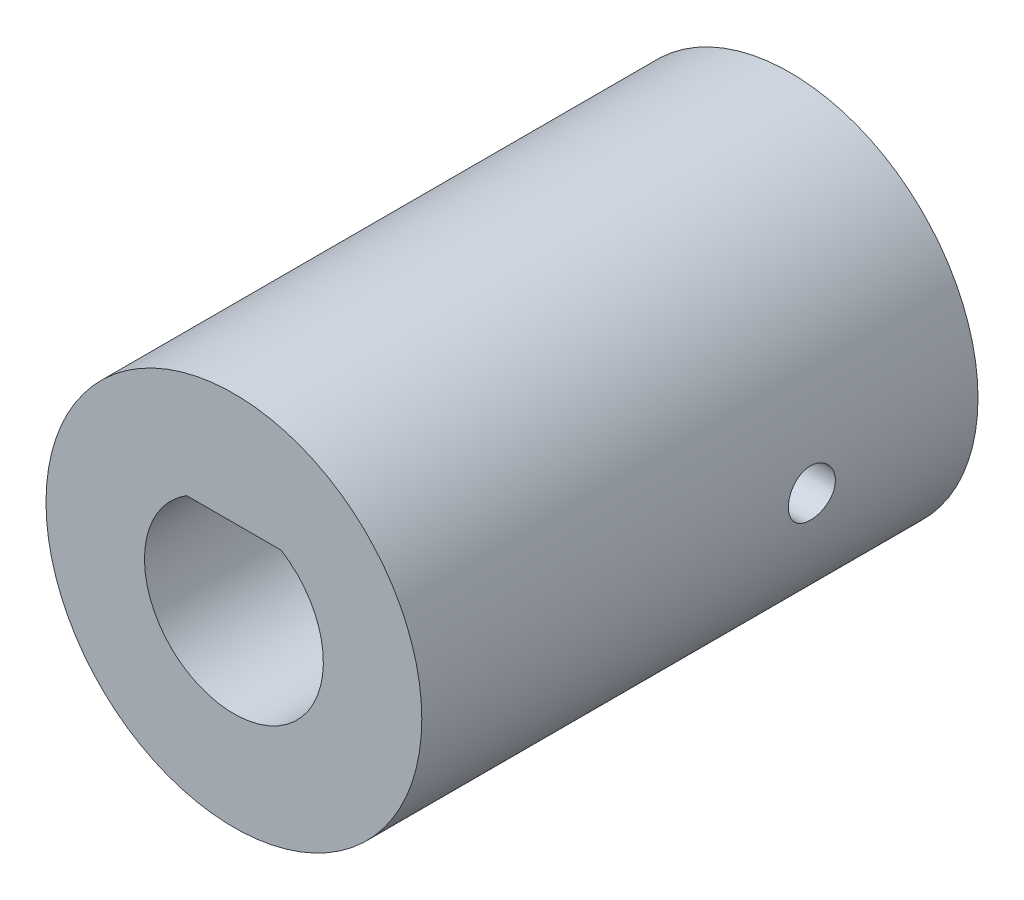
ISO-10303-21;
HEADER;
FILE_DESCRIPTION(('STEP AP214'),'2;1');
FILE_NAME('part.step','',(''),(''),'','','');
FILE_SCHEMA(('AUTOMOTIVE_DESIGN { 1 0 10303 214 1 1 1 1 }'));
ENDSEC;
DATA;
#1=APPLICATION_CONTEXT('core data for automotive mechanical design processes');
#2=APPLICATION_PROTOCOL_DEFINITION('international standard','automotive_design',2000,#1);
#3=PRODUCT_CONTEXT('',#1,'mechanical');
#4=PRODUCT('Part','Part','',(#3));
#5=PRODUCT_RELATED_PRODUCT_CATEGORY('part','',(#4));
#6=PRODUCT_DEFINITION_FORMATION('','',#4);
#7=PRODUCT_DEFINITION_CONTEXT('part definition',#1,'design');
#8=PRODUCT_DEFINITION('design','',#6,#7);
#9=PRODUCT_DEFINITION_SHAPE('','',#8);
#10=(LENGTH_UNIT() NAMED_UNIT(*) SI_UNIT(.MILLI.,.METRE.));
#11=(NAMED_UNIT(*) PLANE_ANGLE_UNIT() SI_UNIT($,.RADIAN.));
#12=(NAMED_UNIT(*) SI_UNIT($,.STERADIAN.) SOLID_ANGLE_UNIT());
#13=UNCERTAINTY_MEASURE_WITH_UNIT(LENGTH_MEASURE(1.E-05),#10,'distance_accuracy_value','');
#14=(GEOMETRIC_REPRESENTATION_CONTEXT(3) GLOBAL_UNCERTAINTY_ASSIGNED_CONTEXT((#13)) GLOBAL_UNIT_ASSIGNED_CONTEXT((#10,
#11,#12)) REPRESENTATION_CONTEXT('',''));
#15=CARTESIAN_POINT('',(0.,0.,0.));
#16=DIRECTION('',(0.,0.,1.));
#17=DIRECTION('',(1.,0.,0.));
#18=AXIS2_PLACEMENT_3D('',#15,#16,#17);
#19=CARTESIAN_POINT('',(0.,0.,18.796));
#20=DIRECTION('',(0.,0.,-1.));
#21=DIRECTION('',(-1.00000000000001,0.,0.));
#22=AXIS2_PLACEMENT_3D('',#19,#20,#21);
#23=CYLINDRICAL_SURFACE('',#22,6.35);
#24=CARTESIAN_POINT('',(-6.35000000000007,0.,4.81965000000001));
#25=CARTESIAN_POINT('',(-6.34999938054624,0.0443995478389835,4.8196518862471));
#26=CARTESIAN_POINT('',(-6.34952941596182,0.0888268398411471,4.82338788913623));
#27=CARTESIAN_POINT('',(-6.34769983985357,0.176445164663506,4.83823256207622));
#28=CARTESIAN_POINT('',(-6.3463392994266,0.219634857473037,4.84934893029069));
#29=CARTESIAN_POINT('',(-6.34288184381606,0.303496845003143,4.87862170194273));
#30=CARTESIAN_POINT('',(-6.34078542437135,0.344170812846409,4.89677336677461));
#31=CARTESIAN_POINT('',(-6.33608937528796,0.421887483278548,4.93959111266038));
#32=CARTESIAN_POINT('',(-6.33348983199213,0.458930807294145,4.9642560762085));
#33=CARTESIAN_POINT('',(-6.32806177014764,0.528546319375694,5.01954544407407));
#34=CARTESIAN_POINT('',(-6.32523218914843,0.561095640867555,5.0501985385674));
#35=CARTESIAN_POINT('',(-6.31967153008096,0.620602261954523,5.11653244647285));
#36=CARTESIAN_POINT('',(-6.31694045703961,0.647559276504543,5.15221351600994));
#37=CARTESIAN_POINT('',(-6.31187557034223,0.695201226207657,5.2277390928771));
#38=CARTESIAN_POINT('',(-6.30954312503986,0.715864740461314,5.26759721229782));
#39=CARTESIAN_POINT('',(-6.30555358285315,0.750196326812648,5.35025188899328));
#40=CARTESIAN_POINT('',(-6.30389646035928,0.763864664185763,5.39304833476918));
#41=CARTESIAN_POINT('',(-6.30145532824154,0.783748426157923,5.4801275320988));
#42=CARTESIAN_POINT('',(-6.30066679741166,0.790002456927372,5.52440133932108));
#43=CARTESIAN_POINT('',(-6.30003828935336,0.794999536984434,5.6133765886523));
#44=CARTESIAN_POINT('',(-6.30019827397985,0.793742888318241,5.65807801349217));
#45=CARTESIAN_POINT('',(-6.30144458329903,0.783785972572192,5.74637053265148));
#46=CARTESIAN_POINT('',(-6.30252561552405,0.77512823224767,5.78996650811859));
#47=CARTESIAN_POINT('',(-6.30548395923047,0.750681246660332,5.87508191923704));
#48=CARTESIAN_POINT('',(-6.30736128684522,0.734891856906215,5.9166013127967));
#49=CARTESIAN_POINT('',(-6.31170669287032,0.696584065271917,5.99651708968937));
#50=CARTESIAN_POINT('',(-6.31417638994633,0.674047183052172,6.03490452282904));
#51=CARTESIAN_POINT('',(-6.31942700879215,0.622897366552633,6.10736862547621));
#52=CARTESIAN_POINT('',(-6.32220794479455,0.594284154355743,6.14144509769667));
#53=CARTESIAN_POINT('',(-6.32779122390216,0.53155821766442,6.20456681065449));
#54=CARTESIAN_POINT('',(-6.33059358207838,0.497408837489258,6.2335756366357));
#55=CARTESIAN_POINT('',(-6.33588595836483,0.424706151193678,6.28545506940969));
#56=CARTESIAN_POINT('',(-6.33837597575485,0.386152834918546,6.30832566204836));
#57=CARTESIAN_POINT('',(-6.34276465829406,0.305708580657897,6.3472794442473));
#58=CARTESIAN_POINT('',(-6.34466312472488,0.263816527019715,6.36336035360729));
#59=CARTESIAN_POINT('',(-6.3476529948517,0.177897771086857,6.38824938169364));
#60=CARTESIAN_POINT('',(-6.34874443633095,0.133871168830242,6.39705784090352));
#61=CARTESIAN_POINT('',(-6.34999236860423,0.0452479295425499,6.40710473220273));
#62=CARTESIAN_POINT('',(-6.35015505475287,0.000657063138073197,6.40839332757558));
#63=CARTESIAN_POINT('',(-6.34954387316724,-0.0881049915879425,6.40349629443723));
#64=CARTESIAN_POINT('',(-6.34877002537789,-0.132276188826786,6.39731082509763));
#65=CARTESIAN_POINT('',(-6.34637659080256,-0.218797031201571,6.37768291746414));
#66=CARTESIAN_POINT('',(-6.34475979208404,-0.261152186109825,6.36426439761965));
#67=CARTESIAN_POINT('',(-6.34086147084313,-0.343011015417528,6.33057615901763));
#68=CARTESIAN_POINT('',(-6.33857992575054,-0.382514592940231,6.31030620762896));
#69=CARTESIAN_POINT('',(-6.33359103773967,-0.457772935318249,6.26336912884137));
#70=CARTESIAN_POINT('',(-6.33088155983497,-0.493507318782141,6.23666955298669));
#71=CARTESIAN_POINT('',(-6.32534657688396,-0.560005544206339,6.17767703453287));
#72=CARTESIAN_POINT('',(-6.32252106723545,-0.590769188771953,6.1453838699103));
#73=CARTESIAN_POINT('',(-6.31705335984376,-0.646630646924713,6.0758998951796));
#74=CARTESIAN_POINT('',(-6.31441229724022,-0.671695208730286,6.03868225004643));
#75=CARTESIAN_POINT('',(-6.30963118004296,-0.715217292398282,5.96053600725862));
#76=CARTESIAN_POINT('',(-6.30749111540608,-0.733674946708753,5.91960748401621));
#77=CARTESIAN_POINT('',(-6.30396202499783,-0.76340543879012,5.83530858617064));
#78=CARTESIAN_POINT('',(-6.30257104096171,-0.774697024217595,5.79194490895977));
#79=CARTESIAN_POINT('',(-6.30069198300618,-0.789835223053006,5.70391846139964));
#80=CARTESIAN_POINT('',(-6.30020386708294,-0.793682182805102,5.65925575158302));
#81=CARTESIAN_POINT('',(-6.30018703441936,-0.793815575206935,5.57022986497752));
#82=CARTESIAN_POINT('',(-6.30065168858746,-0.790154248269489,5.52586675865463));
#83=CARTESIAN_POINT('',(-6.30247378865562,-0.775485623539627,5.43839173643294));
#84=CARTESIAN_POINT('',(-6.30383123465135,-0.764478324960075,5.39527982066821));
#85=CARTESIAN_POINT('',(-6.30728391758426,-0.735446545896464,5.31153784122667));
#86=CARTESIAN_POINT('',(-6.3093788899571,-0.717424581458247,5.27090689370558));
#87=CARTESIAN_POINT('',(-6.3140710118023,-0.674880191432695,5.19323743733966));
#88=CARTESIAN_POINT('',(-6.31666816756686,-0.650357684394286,5.1561989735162));
#89=CARTESIAN_POINT('',(-6.32209367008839,-0.595314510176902,5.0864988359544));
#90=CARTESIAN_POINT('',(-6.3249234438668,-0.564754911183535,5.0538680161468));
#91=CARTESIAN_POINT('',(-6.33048274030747,-0.498586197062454,4.99417758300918));
#92=CARTESIAN_POINT('',(-6.33321223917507,-0.462975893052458,4.96711928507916));
#93=CARTESIAN_POINT('',(-6.33827490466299,-0.38756133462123,4.91925439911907));
#94=CARTESIAN_POINT('',(-6.34060652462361,-0.347741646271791,4.89847197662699));
#95=CARTESIAN_POINT('',(-6.34459503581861,-0.265170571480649,4.86391863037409));
#96=CARTESIAN_POINT('',(-6.34625265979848,-0.222422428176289,4.85014008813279));
#97=CARTESIAN_POINT('',(-6.34830683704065,-0.149544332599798,4.83328366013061));
#98=CARTESIAN_POINT('',(-6.34893867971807,-0.119873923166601,4.82817838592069));
#99=CARTESIAN_POINT('',(-6.34978546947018,-0.0601399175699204,4.82136092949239));
#100=CARTESIAN_POINT('',(-6.35000041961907,-0.0300763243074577,4.81964872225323));
#101=CARTESIAN_POINT('',(-6.35000000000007,0.,4.81965000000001));
#102=B_SPLINE_CURVE_WITH_KNOTS('',3,(#24,#25,#26,#27,#28,#29,#30,#31,#32,#33,#34,#35,#36,#37,
#38,#39,#40,#41,#42,#43,#44,#45,#46,#47,#48,#49,#50,#51,#52,#53,#54,#55,#56,#57,#58,#59,#60,#61,
#62,#63,#64,#65,#66,#67,#68,#69,#70,#71,#72,#73,#74,#75,#76,#77,#78,#79,#80,#81,#82,#83,#84,#85,
#86,#87,#88,#89,#90,#91,#92,#93,#94,#95,#96,#97,#98,#99,#100,#101),.UNSPECIFIED.,.T.,.F.,(4,2,2,
2,2,2,2,2,2,2,2,2,2,2,2,2,2,2,2,2,2,2,2,2,2,2,2,2,2,2,2,2,2,2,2,2,2,2,4),(0.,0.133088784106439,
0.266316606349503,0.399454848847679,0.532570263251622,0.666339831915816,0.800116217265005,
0.934342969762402,1.06856463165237,1.20208429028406,1.3355985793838,1.46835081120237,
1.60110573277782,1.73422762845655,1.86735561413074,2.00140404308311,2.13545278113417,
2.26954650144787,2.40363394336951,2.53682588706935,2.67001499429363,2.80276634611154,
2.93552220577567,3.06896262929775,3.20240835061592,3.33661375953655,3.47081647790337,
3.60466663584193,3.73851056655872,3.87142641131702,4.00434227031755,4.13721049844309,
4.27008039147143,4.40383687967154,4.53762490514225,4.67192170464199,4.8060721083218,
4.89622732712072,4.9863818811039),.UNSPECIFIED.);
#103=CARTESIAN_POINT('',(-6.35000000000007,0.,4.81965000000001));
#104=VERTEX_POINT('',#103);
#105=EDGE_CURVE('E77',#104,#104,#102,.T.);
#106=ORIENTED_EDGE('',*,*,#105,.T.);
#107=EDGE_LOOP('',(#106));
#108=FACE_BOUND('',#107,.T.);
#109=CARTESIAN_POINT('',(6.35000000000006,0.,4.81965000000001));
#110=CARTESIAN_POINT('',(6.34999938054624,-0.0443995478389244,4.8196518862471));
#111=CARTESIAN_POINT('',(6.34952941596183,-0.0888268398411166,4.82338788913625));
#112=CARTESIAN_POINT('',(6.34769983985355,-0.176445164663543,4.83823256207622));
#113=CARTESIAN_POINT('',(6.34633929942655,-0.219634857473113,4.84934893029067));
#114=CARTESIAN_POINT('',(6.34288184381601,-0.303496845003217,4.87862170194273));
#115=CARTESIAN_POINT('',(6.34078542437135,-0.344170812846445,4.89677336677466));
#116=CARTESIAN_POINT('',(6.33608937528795,-0.421887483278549,4.93959111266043));
#117=CARTESIAN_POINT('',(6.33348983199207,-0.458930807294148,4.96425607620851));
#118=CARTESIAN_POINT('',(6.32806177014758,-0.528546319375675,5.01954544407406));
#119=CARTESIAN_POINT('',(6.32523218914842,-0.561095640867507,5.05019853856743));
#120=CARTESIAN_POINT('',(6.31967153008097,-0.620602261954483,5.11653244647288));
#121=CARTESIAN_POINT('',(6.31694045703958,-0.647559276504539,5.15221351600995));
#122=CARTESIAN_POINT('',(6.31187557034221,-0.695201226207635,5.2277390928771));
#123=CARTESIAN_POINT('',(6.30954312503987,-0.715864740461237,5.26759721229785));
#124=CARTESIAN_POINT('',(6.30555358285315,-0.750196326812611,5.35025188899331));
#125=CARTESIAN_POINT('',(6.30389646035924,-0.763864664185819,5.39304833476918));
#126=CARTESIAN_POINT('',(6.30145532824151,-0.783748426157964,5.48012753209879));
#127=CARTESIAN_POINT('',(6.30066679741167,-0.790002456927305,5.52440133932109));
#128=CARTESIAN_POINT('',(6.30003828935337,-0.794999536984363,5.61337658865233));
#129=CARTESIAN_POINT('',(6.30019827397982,-0.793742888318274,5.65807801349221));
#130=CARTESIAN_POINT('',(6.30144458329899,-0.783785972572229,5.7463705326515));
#131=CARTESIAN_POINT('',(6.30252561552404,-0.775128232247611,5.78996650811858));
#132=CARTESIAN_POINT('',(6.30548395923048,-0.750681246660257,5.87508191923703));
#133=CARTESIAN_POINT('',(6.30736128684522,-0.734891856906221,5.91660131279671));
#134=CARTESIAN_POINT('',(6.31170669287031,-0.696584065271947,5.99651708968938));
#135=CARTESIAN_POINT('',(6.31417638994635,-0.674047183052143,6.03490452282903));
#136=CARTESIAN_POINT('',(6.31942700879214,-0.622897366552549,6.10736862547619));
#137=CARTESIAN_POINT('',(6.32220794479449,-0.594284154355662,6.14144509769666));
#138=CARTESIAN_POINT('',(6.32779122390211,-0.531558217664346,6.20456681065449));
#139=CARTESIAN_POINT('',(6.33059358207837,-0.49740883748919,6.23357563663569));
#140=CARTESIAN_POINT('',(6.33588595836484,-0.424706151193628,6.28545506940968));
#141=CARTESIAN_POINT('',(6.33837597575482,-0.386152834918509,6.30832566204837));
#142=CARTESIAN_POINT('',(6.34276465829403,-0.305708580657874,6.3472794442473));
#143=CARTESIAN_POINT('',(6.34466312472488,-0.263816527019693,6.36336035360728));
#144=CARTESIAN_POINT('',(6.3476529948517,-0.177897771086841,6.38824938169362));
#145=CARTESIAN_POINT('',(6.34874443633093,-0.133871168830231,6.39705784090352));
#146=CARTESIAN_POINT('',(6.34999236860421,-0.04524792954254,6.40710473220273));
#147=CARTESIAN_POINT('',(6.35015505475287,-0.000657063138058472,6.40839332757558));
#148=CARTESIAN_POINT('',(6.34954387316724,0.0881049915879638,6.40349629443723));
#149=CARTESIAN_POINT('',(6.34877002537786,0.132276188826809,6.39731082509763));
#150=CARTESIAN_POINT('',(6.34637659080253,0.218797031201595,6.37768291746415));
#151=CARTESIAN_POINT('',(6.34475979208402,0.261152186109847,6.36426439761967));
#152=CARTESIAN_POINT('',(6.34086147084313,0.343011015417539,6.33057615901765));
#153=CARTESIAN_POINT('',(6.33857992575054,0.382514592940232,6.31030620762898));
#154=CARTESIAN_POINT('',(6.33359103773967,0.457772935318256,6.2633691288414));
#155=CARTESIAN_POINT('',(6.33088155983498,0.493507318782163,6.23666955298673));
#156=CARTESIAN_POINT('',(6.32534657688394,0.56000554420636,6.17767703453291));
#157=CARTESIAN_POINT('',(6.3225210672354,0.590769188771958,6.14538386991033));
#158=CARTESIAN_POINT('',(6.31705335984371,0.646630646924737,6.07589989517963));
#159=CARTESIAN_POINT('',(6.31441229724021,0.671695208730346,6.03868225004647));
#160=CARTESIAN_POINT('',(6.30963118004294,0.715217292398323,5.96053600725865));
#161=CARTESIAN_POINT('',(6.30749111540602,0.733674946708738,5.91960748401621));
#162=CARTESIAN_POINT('',(6.30396202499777,0.763405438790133,5.83530858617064));
#163=CARTESIAN_POINT('',(6.30257104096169,0.774697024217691,5.79194490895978));
#164=CARTESIAN_POINT('',(6.30069198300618,0.789835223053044,5.70391846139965));
#165=CARTESIAN_POINT('',(6.30020386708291,0.793682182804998,5.65925575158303));
#166=CARTESIAN_POINT('',(6.30018703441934,0.793815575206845,5.5702298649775));
#167=CARTESIAN_POINT('',(6.30065168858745,0.790154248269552,5.5258667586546));
#168=CARTESIAN_POINT('',(6.30247378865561,0.775485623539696,5.43839173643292));
#169=CARTESIAN_POINT('',(6.30383123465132,0.764478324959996,5.39527982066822));
#170=CARTESIAN_POINT('',(6.30728391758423,0.735446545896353,5.31153784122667));
#171=CARTESIAN_POINT('',(6.30937888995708,0.717424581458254,5.27090689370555));
#172=CARTESIAN_POINT('',(6.31407101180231,0.674880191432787,5.19323743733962));
#173=CARTESIAN_POINT('',(6.31666816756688,0.650357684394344,5.15619897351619));
#174=CARTESIAN_POINT('',(6.3220936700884,0.595314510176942,5.08649883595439));
#175=CARTESIAN_POINT('',(6.3249234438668,0.564754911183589,5.05386801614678));
#176=CARTESIAN_POINT('',(6.33048274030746,0.498586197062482,4.99417758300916));
#177=CARTESIAN_POINT('',(6.33321223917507,0.462975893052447,4.96711928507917));
#178=CARTESIAN_POINT('',(6.33827490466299,0.387561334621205,4.91925439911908));
#179=CARTESIAN_POINT('',(6.3406065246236,0.347741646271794,4.89847197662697));
#180=CARTESIAN_POINT('',(6.3445950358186,0.265170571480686,4.86391863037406));
#181=CARTESIAN_POINT('',(6.34625265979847,0.222422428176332,4.85014008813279));
#182=CARTESIAN_POINT('',(6.34830683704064,0.149544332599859,4.83328366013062));
#183=CARTESIAN_POINT('',(6.34893867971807,0.11987392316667,4.82817838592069));
#184=CARTESIAN_POINT('',(6.34978546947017,0.060139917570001,4.82136092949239));
#185=CARTESIAN_POINT('',(6.35000041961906,0.0300763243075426,4.81964872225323));
#186=CARTESIAN_POINT('',(6.35000000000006,0.,4.81965000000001));
#187=B_SPLINE_CURVE_WITH_KNOTS('',3,(#109,#110,#111,#112,#113,#114,#115,#116,#117,#118,#119,
#120,#121,#122,#123,#124,#125,#126,#127,#128,#129,#130,#131,#132,#133,#134,#135,#136,#137,#138,
#139,#140,#141,#142,#143,#144,#145,#146,#147,#148,#149,#150,#151,#152,#153,#154,#155,#156,#157,
#158,#159,#160,#161,#162,#163,#164,#165,#166,#167,#168,#169,#170,#171,#172,#173,#174,#175,#176,
#177,#178,#179,#180,#181,#182,#183,#184,#185,#186),.UNSPECIFIED.,.T.,.F.,(4,2,2,2,2,2,2,2,2,2,2,
2,2,2,2,2,2,2,2,2,2,2,2,2,2,2,2,2,2,2,2,2,2,2,2,2,2,2,4),(0.,0.133088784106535,
0.266316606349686,0.399454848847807,0.5325702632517,0.66633983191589,0.800116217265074,
0.934342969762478,1.06856463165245,1.20208429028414,1.33559857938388,1.46835081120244,
1.60110573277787,1.73422762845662,1.86735561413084,2.00140404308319,2.13545278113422,
2.26954650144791,2.40363394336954,2.5368258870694,2.67001499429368,2.80276634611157,
2.93552220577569,3.06896262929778,3.20240835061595,3.33661375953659,3.47081647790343,
3.60466663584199,3.73851056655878,3.8714264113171,4.00434227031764,4.13721049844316,
4.27008039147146,4.4038368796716,4.53762490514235,4.67192170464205,4.80607210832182,
4.89622732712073,4.98638188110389),.UNSPECIFIED.);
#188=CARTESIAN_POINT('',(6.35000000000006,0.,4.81965000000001));
#189=VERTEX_POINT('',#188);
#190=EDGE_CURVE('E105',#189,#189,#187,.T.);
#191=ORIENTED_EDGE('',*,*,#190,.T.);
#192=EDGE_LOOP('',(#191));
#193=FACE_BOUND('',#192,.T.);
#194=CARTESIAN_POINT('',(0.,0.,18.796));
#195=DIRECTION('',(0.,0.,1.));
#196=DIRECTION('',(1.00000000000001,0.,0.));
#197=AXIS2_PLACEMENT_3D('',#194,#195,#196);
#198=CIRCLE('',#197,6.35);
#199=CARTESIAN_POINT('',(6.35000000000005,0.,18.796));
#200=VERTEX_POINT('',#199);
#201=EDGE_CURVE('E11',#200,#200,#198,.T.);
#202=ORIENTED_EDGE('',*,*,#201,.F.);
#203=EDGE_LOOP('',(#202));
#204=FACE_BOUND('',#203,.T.);
#205=CARTESIAN_POINT('',(0.,0.,0.));
#206=DIRECTION('',(0.,0.,1.));
#207=DIRECTION('',(1.00000000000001,0.,0.));
#208=AXIS2_PLACEMENT_3D('',#205,#206,#207);
#209=CIRCLE('',#208,6.35);
#210=CARTESIAN_POINT('',(6.35000000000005,0.,0.));
#211=VERTEX_POINT('',#210);
#212=EDGE_CURVE('E47',#211,#211,#209,.T.);
#213=ORIENTED_EDGE('',*,*,#212,.T.);
#214=EDGE_LOOP('',(#213));
#215=FACE_BOUND('',#214,.T.);
#216=ADVANCED_FACE('F34',(#108,#193,#204,#215),#23,.T.);
#217=CARTESIAN_POINT('',(0.,0.,18.796));
#218=DIRECTION('',(0.,0.,1.));
#219=DIRECTION('',(1.00000000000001,0.,0.));
#220=AXIS2_PLACEMENT_3D('',#217,#218,#219);
#221=PLANE('',#220);
#222=DIRECTION('',(-1.00000000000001,0.,0.));
#223=VECTOR('',#222,1.);
#224=CARTESIAN_POINT('',(0.,2.56539999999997,18.796));
#225=LINE('',#224,#223);
#226=CARTESIAN_POINT('',(1.59838468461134,2.56539999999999,18.796));
#227=VERTEX_POINT('',#226);
#228=CARTESIAN_POINT('',(-1.59838468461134,2.56539999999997,18.796));
#229=VERTEX_POINT('',#228);
#230=EDGE_CURVE('E68',#227,#229,#225,.T.);
#231=ORIENTED_EDGE('',*,*,#230,.F.);
#232=CARTESIAN_POINT('',(0.,0.,18.796));
#233=DIRECTION('',(0.,0.,1.));
#234=DIRECTION('',(1.00000000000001,0.,0.));
#235=AXIS2_PLACEMENT_3D('',#232,#233,#234);
#236=CIRCLE('',#235,3.0226);
#237=EDGE_CURVE('E74',#229,#227,#236,.T.);
#238=ORIENTED_EDGE('',*,*,#237,.F.);
#239=EDGE_LOOP('',(#231,#238));
#240=FACE_BOUND('',#239,.T.);
#241=ORIENTED_EDGE('',*,*,#201,.T.);
#242=EDGE_LOOP('',(#241));
#243=FACE_BOUND('',#242,.T.);
#244=ADVANCED_FACE('F79',(#240,#243),#221,.T.);
#245=CARTESIAN_POINT('',(0.,0.,0.));
#246=DIRECTION('',(0.,0.,1.));
#247=DIRECTION('',(1.00000000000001,0.,0.));
#248=AXIS2_PLACEMENT_3D('',#245,#246,#247);
#249=PLANE('',#248);
#250=CARTESIAN_POINT('',(0.,0.,0.));
#251=DIRECTION('',(0.,0.,1.));
#252=DIRECTION('',(1.00000000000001,0.,0.));
#253=AXIS2_PLACEMENT_3D('',#250,#251,#252);
#254=CIRCLE('',#253,3.0226);
#255=CARTESIAN_POINT('',(-1.59838468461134,2.56540000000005,0.));
#256=VERTEX_POINT('',#255);
#257=CARTESIAN_POINT('',(1.59838468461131,2.56540000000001,0.));
#258=VERTEX_POINT('',#257);
#259=EDGE_CURVE('E82',#256,#258,#254,.T.);
#260=ORIENTED_EDGE('',*,*,#259,.T.);
#261=DIRECTION('',(-1.00000000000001,0.,0.));
#262=VECTOR('',#261,1.);
#263=CARTESIAN_POINT('',(0.,2.5654,0.));
#264=LINE('',#263,#262);
#265=EDGE_CURVE('E71',#258,#256,#264,.T.);
#266=ORIENTED_EDGE('',*,*,#265,.T.);
#267=EDGE_LOOP('',(#260,#266));
#268=FACE_BOUND('',#267,.T.);
#269=ORIENTED_EDGE('',*,*,#212,.F.);
#270=EDGE_LOOP('',(#269));
#271=FACE_BOUND('',#270,.T.);
#272=ADVANCED_FACE('F123',(#268,#271),#249,.F.);
#273=CARTESIAN_POINT('',(0.,2.5654,0.));
#274=DIRECTION('',(0.,1.00000000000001,0.));
#275=DIRECTION('',(-1.00000000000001,0.,0.));
#276=AXIS2_PLACEMENT_3D('',#273,#274,#275);
#277=PLANE('',#276);
#278=ORIENTED_EDGE('',*,*,#230,.T.);
#279=DIRECTION('',(0.,0.,1.));
#280=VECTOR('',#279,1.);
#281=CARTESIAN_POINT('',(-1.59838468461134,2.56540000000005,0.));
#282=LINE('',#281,#280);
#283=EDGE_CURVE('E55',#256,#229,#282,.T.);
#284=ORIENTED_EDGE('',*,*,#283,.F.);
#285=ORIENTED_EDGE('',*,*,#265,.F.);
#286=DIRECTION('',(0.,0.,1.));
#287=VECTOR('',#286,1.);
#288=CARTESIAN_POINT('',(1.59838468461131,2.56540000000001,0.));
#289=LINE('',#288,#287);
#290=EDGE_CURVE('E60',#258,#227,#289,.T.);
#291=ORIENTED_EDGE('',*,*,#290,.T.);
#292=EDGE_LOOP('',(#278,#284,#285,#291));
#293=FACE_BOUND('',#292,.T.);
#294=ADVANCED_FACE('F66',(#293),#277,.F.);
#295=CARTESIAN_POINT('',(0.,0.,0.));
#296=DIRECTION('',(0.,0.,1.));
#297=DIRECTION('',(1.00000000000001,0.,0.));
#298=AXIS2_PLACEMENT_3D('',#295,#296,#297);
#299=CYLINDRICAL_SURFACE('',#298,3.0226);
#300=CARTESIAN_POINT('',(-3.02260000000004,0.,4.81965000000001));
#301=CARTESIAN_POINT('',(-3.02259931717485,-0.0437816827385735,4.8196510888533));
#302=CARTESIAN_POINT('',(-3.02163935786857,-0.0875751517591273,4.82328452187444));
#303=CARTESIAN_POINT('',(-3.01790306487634,-0.17390212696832,4.83769751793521));
#304=CARTESIAN_POINT('',(-3.01512581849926,-0.216434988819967,4.84848067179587));
#305=CARTESIAN_POINT('',(-3.0080617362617,-0.298982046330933,4.87681956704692));
#306=CARTESIAN_POINT('',(-3.00377681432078,-0.338999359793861,4.89436672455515));
#307=CARTESIAN_POINT('',(-2.99415109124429,-0.415522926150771,4.93570410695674));
#308=CARTESIAN_POINT('',(-2.98881022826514,-0.452028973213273,4.95949469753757));
#309=CARTESIAN_POINT('',(-2.97751542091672,-0.521316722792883,5.01320994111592));
#310=CARTESIAN_POINT('',(-2.97155124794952,-0.554007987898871,5.04324910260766));
#311=CARTESIAN_POINT('',(-2.95974825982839,-0.613951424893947,5.10836390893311));
#312=CARTESIAN_POINT('',(-2.95390946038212,-0.641202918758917,5.14344018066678));
#313=CARTESIAN_POINT('',(-2.94291406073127,-0.689930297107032,5.21835049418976));
#314=CARTESIAN_POINT('',(-2.93777038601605,-0.711302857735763,5.25825381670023));
#315=CARTESIAN_POINT('',(-2.92889771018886,-0.747000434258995,5.34124421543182));
#316=CARTESIAN_POINT('',(-2.9251684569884,-0.761326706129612,5.3843307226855));
#317=CARTESIAN_POINT('',(-2.9196523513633,-0.782212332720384,5.47146458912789));
#318=CARTESIAN_POINT('',(-2.91782464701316,-0.788935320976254,5.51547007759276));
#319=CARTESIAN_POINT('',(-2.91619646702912,-0.794933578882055,5.60401935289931));
#320=CARTESIAN_POINT('',(-2.9163956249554,-0.794210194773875,5.64856304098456));
#321=CARTESIAN_POINT('',(-2.91876206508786,-0.785466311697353,5.73565288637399));
#322=CARTESIAN_POINT('',(-2.9208761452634,-0.777643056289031,5.77822052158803));
#323=CARTESIAN_POINT('',(-2.92674913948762,-0.755237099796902,5.8614168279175));
#324=CARTESIAN_POINT('',(-2.93050818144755,-0.740653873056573,5.90204534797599));
#325=CARTESIAN_POINT('',(-2.93929484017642,-0.704979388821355,5.98072793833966));
#326=CARTESIAN_POINT('',(-2.94433594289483,-0.683818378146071,6.01874881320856));
#327=CARTESIAN_POINT('',(-2.95511137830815,-0.635637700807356,6.09076966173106));
#328=CARTESIAN_POINT('',(-2.96084584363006,-0.608616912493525,6.12476886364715));
#329=CARTESIAN_POINT('',(-2.97258396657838,-0.548471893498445,6.18890904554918));
#330=CARTESIAN_POINT('',(-2.97859040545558,-0.515181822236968,6.21889421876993));
#331=CARTESIAN_POINT('',(-2.99003303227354,-0.44397264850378,6.27288758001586));
#332=CARTESIAN_POINT('',(-2.99546919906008,-0.406053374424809,6.29689554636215));
#333=CARTESIAN_POINT('',(-3.00519056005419,-0.326425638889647,6.33831873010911));
#334=CARTESIAN_POINT('',(-3.0094709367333,-0.284702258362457,6.35570647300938));
#335=CARTESIAN_POINT('',(-3.01636356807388,-0.198786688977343,6.38317642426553));
#336=CARTESIAN_POINT('',(-3.01897617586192,-0.154595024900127,6.39326017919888));
#337=CARTESIAN_POINT('',(-3.02218578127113,-0.0663276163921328,6.40559294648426));
#338=CARTESIAN_POINT('',(-3.02283728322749,-0.02228341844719,6.408053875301));
#339=CARTESIAN_POINT('',(-3.02220760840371,0.0655881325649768,6.40565536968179));
#340=CARTESIAN_POINT('',(-3.02092662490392,0.109415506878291,6.40079666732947));
#341=CARTESIAN_POINT('',(-3.01661104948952,0.194857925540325,6.38407086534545));
#342=CARTESIAN_POINT('',(-3.01360588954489,0.236497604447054,6.37232132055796));
#343=CARTESIAN_POINT('',(-3.00618226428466,0.317211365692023,6.34228331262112));
#344=CARTESIAN_POINT('',(-3.00176364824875,0.356285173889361,6.32399415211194));
#345=CARTESIAN_POINT('',(-2.99187481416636,0.431586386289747,6.28099862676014));
#346=CARTESIAN_POINT('',(-2.98638608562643,0.467744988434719,6.25617612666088));
#347=CARTESIAN_POINT('',(-2.97499181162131,0.535458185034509,6.20096514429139));
#348=CARTESIAN_POINT('',(-2.96908618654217,0.567011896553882,6.17057559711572));
#349=CARTESIAN_POINT('',(-2.95732425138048,0.625507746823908,6.10410538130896));
#350=CARTESIAN_POINT('',(-2.9514736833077,0.652300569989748,6.06789205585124));
#351=CARTESIAN_POINT('',(-2.94066207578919,0.699431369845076,5.99136035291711));
#352=CARTESIAN_POINT('',(-2.93570099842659,0.719769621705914,5.95104215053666));
#353=CARTESIAN_POINT('',(-2.92728665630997,0.753260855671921,5.86765103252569));
#354=CARTESIAN_POINT('',(-2.92382460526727,0.766455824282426,5.82459591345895));
#355=CARTESIAN_POINT('',(-2.9187966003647,0.785388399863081,5.73677209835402));
#356=CARTESIAN_POINT('',(-2.91723017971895,0.791127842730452,5.69200382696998));
#357=CARTESIAN_POINT('',(-2.9162089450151,0.794883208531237,5.60355084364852));
#358=CARTESIAN_POINT('',(-2.91668860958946,0.79313877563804,5.55987690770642));
#359=CARTESIAN_POINT('',(-2.91955257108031,0.782529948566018,5.47346942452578));
#360=CARTESIAN_POINT('',(-2.92193682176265,0.773665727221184,5.43073585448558));
#361=CARTESIAN_POINT('',(-2.92830291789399,0.749205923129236,5.34771352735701));
#362=CARTESIAN_POINT('',(-2.93227304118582,0.733659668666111,5.30740927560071));
#363=CARTESIAN_POINT('',(-2.94136415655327,0.69631554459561,5.22995099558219));
#364=CARTESIAN_POINT('',(-2.94648532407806,0.674516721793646,5.19279744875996));
#365=CARTESIAN_POINT('',(-2.9574844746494,0.624553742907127,5.12154779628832));
#366=CARTESIAN_POINT('',(-2.96337991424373,0.596225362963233,5.08756952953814));
#367=CARTESIAN_POINT('',(-2.97516422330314,0.534321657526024,5.0247711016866));
#368=CARTESIAN_POINT('',(-2.9810530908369,0.500745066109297,4.99595218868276));
#369=CARTESIAN_POINT('',(-2.99230541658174,0.428465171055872,4.94370935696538));
#370=CARTESIAN_POINT('',(-2.99765558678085,0.389670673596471,4.92040850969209));
#371=CARTESIAN_POINT('',(-3.00708369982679,0.308576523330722,4.88069618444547));
#372=CARTESIAN_POINT('',(-3.01116248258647,0.266279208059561,4.86428015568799));
#373=CARTESIAN_POINT('',(-3.01704183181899,0.186764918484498,4.84101882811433));
#374=CARTESIAN_POINT('',(-3.01911117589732,0.149900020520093,4.83302380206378));
#375=CARTESIAN_POINT('',(-3.02189049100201,0.0753596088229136,4.82233916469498));
#376=CARTESIAN_POINT('',(-3.02260058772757,0.0376841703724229,4.81964906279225));
#377=CARTESIAN_POINT('',(-3.02260000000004,0.,4.81965000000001));
#378=B_SPLINE_CURVE_WITH_KNOTS('',3,(#300,#301,#302,#303,#304,#305,#306,#307,#308,#309,#310,
#311,#312,#313,#314,#315,#316,#317,#318,#319,#320,#321,#322,#323,#324,#325,#326,#327,#328,#329,
#330,#331,#332,#333,#334,#335,#336,#337,#338,#339,#340,#341,#342,#343,#344,#345,#346,#347,#348,
#349,#350,#351,#352,#353,#354,#355,#356,#357,#358,#359,#360,#361,#362,#363,#364,#365,#366,#367,
#368,#369,#370,#371,#372,#373,#374,#375,#376,#377),.UNSPECIFIED.,.T.,.F.,(4,2,2,2,2,2,2,2,2,2,2,
2,2,2,2,2,2,2,2,2,2,2,2,2,2,2,2,2,2,2,2,2,2,2,2,2,2,2,4),(0.,0.131206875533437,
0.262479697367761,0.393586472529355,0.524700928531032,0.658471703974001,0.792259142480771,
0.928266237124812,1.06424908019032,1.19724610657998,1.33021908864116,1.45960734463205,
1.58900566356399,1.71982588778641,1.8506711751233,1.98564979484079,2.12063341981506,
2.2561712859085,2.39168044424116,2.52338697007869,2.65508032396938,2.78458983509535,
2.91411316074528,3.04611578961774,3.17814369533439,3.3137739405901,3.44939840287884,
3.58421679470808,3.7190019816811,3.84950392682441,3.98000270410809,4.10955422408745,
4.23912550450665,4.3724026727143,4.50571203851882,4.64176160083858,4.77772109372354,
4.89066512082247,5.00359870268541),.UNSPECIFIED.);
#379=CARTESIAN_POINT('',(-3.02260000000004,0.,4.81965000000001));
#380=VERTEX_POINT('',#379);
#381=EDGE_CURVE('E38',#380,#380,#378,.T.);
#382=ORIENTED_EDGE('',*,*,#381,.T.);
#383=EDGE_LOOP('',(#382));
#384=FACE_BOUND('',#383,.T.);
#385=CARTESIAN_POINT('',(3.0226,0.,4.8196500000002));
#386=CARTESIAN_POINT('',(3.02259931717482,0.0437816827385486,4.8196510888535));
#387=CARTESIAN_POINT('',(3.02163935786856,0.087575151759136,4.82328452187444));
#388=CARTESIAN_POINT('',(3.01790306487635,0.173902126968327,4.8376975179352));
#389=CARTESIAN_POINT('',(3.01512581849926,0.216434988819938,4.84848067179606));
#390=CARTESIAN_POINT('',(3.00806173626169,0.298982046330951,4.87681956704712));
#391=CARTESIAN_POINT('',(3.00377681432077,0.33899935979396,4.89436672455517));
#392=CARTESIAN_POINT('',(2.99415109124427,0.415522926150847,4.93570410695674));
#393=CARTESIAN_POINT('',(2.98881022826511,0.452028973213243,4.95949469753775));
#394=CARTESIAN_POINT('',(2.9775154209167,0.521316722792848,5.01320994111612));
#395=CARTESIAN_POINT('',(2.97155124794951,0.554007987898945,5.0432491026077));
#396=CARTESIAN_POINT('',(2.95974825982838,0.613951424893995,5.10836390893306));
#397=CARTESIAN_POINT('',(2.95390946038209,0.641202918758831,5.14344018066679));
#398=CARTESIAN_POINT('',(2.94291406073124,0.689930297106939,5.21835049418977));
#399=CARTESIAN_POINT('',(2.93777038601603,0.711302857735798,5.25825381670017));
#400=CARTESIAN_POINT('',(2.92889771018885,0.747000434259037,5.34124421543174));
#401=CARTESIAN_POINT('',(2.92516845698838,0.761326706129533,5.38433072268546));
#402=CARTESIAN_POINT('',(2.91965235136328,0.782212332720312,5.47146458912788));
#403=CARTESIAN_POINT('',(2.91782464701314,0.788935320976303,5.51547007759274));
#404=CARTESIAN_POINT('',(2.9161964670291,0.794933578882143,5.6040193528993));
#405=CARTESIAN_POINT('',(2.91639562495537,0.794210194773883,5.64856304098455));
#406=CARTESIAN_POINT('',(2.91876206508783,0.78546631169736,5.73565288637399));
#407=CARTESIAN_POINT('',(2.92087614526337,0.777643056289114,5.77822052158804));
#408=CARTESIAN_POINT('',(2.9267491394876,0.755237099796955,5.8614168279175));
#409=CARTESIAN_POINT('',(2.93050818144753,0.740653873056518,5.90204534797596));
#410=CARTESIAN_POINT('',(2.9392948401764,0.704979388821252,5.98072793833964));
#411=CARTESIAN_POINT('',(2.94433594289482,0.683818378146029,6.01874881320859));
#412=CARTESIAN_POINT('',(2.95511137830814,0.63563770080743,6.09076966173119));
#413=CARTESIAN_POINT('',(2.96084584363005,0.608616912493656,6.12476886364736));
#414=CARTESIAN_POINT('',(2.97258396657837,0.548471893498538,6.18890904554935));
#415=CARTESIAN_POINT('',(2.97859040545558,0.51518182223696,6.21889421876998));
#416=CARTESIAN_POINT('',(2.99003303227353,0.443972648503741,6.27288758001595));
#417=CARTESIAN_POINT('',(2.99546919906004,0.406053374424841,6.29689554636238));
#418=CARTESIAN_POINT('',(3.00519056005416,0.326425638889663,6.33831873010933));
#419=CARTESIAN_POINT('',(3.00947093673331,0.284702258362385,6.35570647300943));
#420=CARTESIAN_POINT('',(3.01636356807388,0.198786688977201,6.38317642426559));
#421=CARTESIAN_POINT('',(3.01897617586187,0.154595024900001,6.39326017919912));
#422=CARTESIAN_POINT('',(3.02218578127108,0.0663276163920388,6.40559294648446));
#423=CARTESIAN_POINT('',(3.02283728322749,0.0222834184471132,6.408053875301));
#424=CARTESIAN_POINT('',(3.02220760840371,-0.0655881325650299,6.40565536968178));
#425=CARTESIAN_POINT('',(3.02092662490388,-0.109415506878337,6.40079666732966));
#426=CARTESIAN_POINT('',(3.01661104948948,-0.194857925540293,6.38407086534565));
#427=CARTESIAN_POINT('',(3.0136058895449,-0.236497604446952,6.37232132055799));
#428=CARTESIAN_POINT('',(3.00618226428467,-0.317211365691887,6.34228331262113));
#429=CARTESIAN_POINT('',(3.00176364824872,-0.356285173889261,6.3239941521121));
#430=CARTESIAN_POINT('',(2.99187481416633,-0.431586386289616,6.28099862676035));
#431=CARTESIAN_POINT('',(2.98638608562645,-0.467744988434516,6.25617612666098));
#432=CARTESIAN_POINT('',(2.97499181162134,-0.535458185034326,6.20096514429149));
#433=CARTESIAN_POINT('',(2.96908618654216,-0.567011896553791,6.17057559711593));
#434=CARTESIAN_POINT('',(2.95732425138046,-0.625507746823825,6.10410538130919));
#435=CARTESIAN_POINT('',(2.95147368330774,-0.652300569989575,6.06789205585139));
#436=CARTESIAN_POINT('',(2.94066207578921,-0.699431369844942,5.99136035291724));
#437=CARTESIAN_POINT('',(2.93570099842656,-0.71976962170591,5.95104215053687));
#438=CARTESIAN_POINT('',(2.92728665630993,-0.753260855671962,5.86765103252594));
#439=CARTESIAN_POINT('',(2.92382460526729,-0.766455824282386,5.82459591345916));
#440=CARTESIAN_POINT('',(2.91879660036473,-0.785388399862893,5.73677209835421));
#441=CARTESIAN_POINT('',(2.91723017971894,-0.791127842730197,5.69200382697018));
#442=CARTESIAN_POINT('',(2.91620894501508,-0.794883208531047,5.60355084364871));
#443=CARTESIAN_POINT('',(2.91668860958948,-0.793138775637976,5.5598769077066));
#444=CARTESIAN_POINT('',(2.91955257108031,-0.782529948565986,5.47346942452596));
#445=CARTESIAN_POINT('',(2.92193682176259,-0.77366572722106,5.43073585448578));
#446=CARTESIAN_POINT('',(2.92830291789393,-0.749205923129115,5.34771352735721));
#447=CARTESIAN_POINT('',(2.93227304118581,-0.733659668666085,5.30740927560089));
#448=CARTESIAN_POINT('',(2.94136415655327,-0.696315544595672,5.22995099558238));
#449=CARTESIAN_POINT('',(2.94648532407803,-0.6745167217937,5.19279744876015));
#450=CARTESIAN_POINT('',(2.95748447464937,-0.6245537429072,5.12154779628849));
#451=CARTESIAN_POINT('',(2.96337991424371,-0.59622536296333,5.08756952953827));
#452=CARTESIAN_POINT('',(2.97516422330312,-0.534321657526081,5.02477110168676));
#453=CARTESIAN_POINT('',(2.98105309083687,-0.500745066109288,4.99595218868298));
#454=CARTESIAN_POINT('',(2.99230541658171,-0.428465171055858,4.94370935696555));
#455=CARTESIAN_POINT('',(2.99765558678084,-0.389670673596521,4.92040850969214));
#456=CARTESIAN_POINT('',(3.00708369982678,-0.308576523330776,4.88069618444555));
#457=CARTESIAN_POINT('',(3.01116248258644,-0.266279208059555,4.86428015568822));
#458=CARTESIAN_POINT('',(3.01704183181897,-0.186764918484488,4.84101882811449));
#459=CARTESIAN_POINT('',(3.01911117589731,-0.149900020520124,4.83302380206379));
#460=CARTESIAN_POINT('',(3.021890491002,-0.0753596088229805,4.822339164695));
#461=CARTESIAN_POINT('',(3.02260058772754,-0.0376841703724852,4.81964906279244));
#462=CARTESIAN_POINT('',(3.0226,0.,4.8196500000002));
#463=B_SPLINE_CURVE_WITH_KNOTS('',3,(#385,#386,#387,#388,#389,#390,#391,#392,#393,#394,#395,
#396,#397,#398,#399,#400,#401,#402,#403,#404,#405,#406,#407,#408,#409,#410,#411,#412,#413,#414,
#415,#416,#417,#418,#419,#420,#421,#422,#423,#424,#425,#426,#427,#428,#429,#430,#431,#432,#433,
#434,#435,#436,#437,#438,#439,#440,#441,#442,#443,#444,#445,#446,#447,#448,#449,#450,#451,#452,
#453,#454,#455,#456,#457,#458,#459,#460,#461,#462),.UNSPECIFIED.,.T.,.F.,(4,2,2,2,2,2,2,2,2,2,2,
2,2,2,2,2,2,2,2,2,2,2,2,2,2,2,2,2,2,2,2,2,2,2,2,2,2,2,4),(0.,0.131206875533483,
0.262479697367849,0.393586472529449,0.524700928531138,0.658471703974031,0.792259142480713,
0.928266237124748,1.06424908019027,1.19724610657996,1.33021908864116,1.45960734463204,
1.589005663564,1.71982588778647,1.85067117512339,1.9856497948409,2.12063341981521,
2.2561712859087,2.39168044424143,2.52338697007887,2.65508032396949,2.78458983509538,
2.91411316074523,3.04611578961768,3.17814369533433,3.31377394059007,3.44939840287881,
3.58421679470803,3.71900198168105,3.84950392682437,3.98000270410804,4.10955422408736,
4.23912550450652,4.37240267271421,4.50571203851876,4.64176160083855,4.77772109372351,
4.89066512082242,5.00359870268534),.UNSPECIFIED.);
#464=CARTESIAN_POINT('',(3.0226,0.,4.8196500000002));
#465=VERTEX_POINT('',#464);
#466=EDGE_CURVE('E89',#465,#465,#463,.T.);
#467=ORIENTED_EDGE('',*,*,#466,.T.);
#468=EDGE_LOOP('',(#467));
#469=FACE_BOUND('',#468,.T.);
#470=ORIENTED_EDGE('',*,*,#237,.T.);
#471=ORIENTED_EDGE('',*,*,#290,.F.);
#472=ORIENTED_EDGE('',*,*,#259,.F.);
#473=ORIENTED_EDGE('',*,*,#283,.T.);
#474=EDGE_LOOP('',(#470,#471,#472,#473));
#475=FACE_BOUND('',#474,.T.);
#476=ADVANCED_FACE('F75',(#384,#469,#475),#299,.F.);
#477=CARTESIAN_POINT('',(-6.35000000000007,0.,5.61339999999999));
#478=DIRECTION('',(1.00000000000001,0.,0.));
#479=DIRECTION('',(0.,0.,-1.));
#480=AXIS2_PLACEMENT_3D('',#477,#478,#479);
#481=CYLINDRICAL_SURFACE('',#480,0.79375);
#482=ORIENTED_EDGE('',*,*,#466,.F.);
#483=EDGE_LOOP('',(#482));
#484=FACE_BOUND('',#483,.T.);
#485=ORIENTED_EDGE('',*,*,#190,.F.);
#486=EDGE_LOOP('',(#485));
#487=FACE_BOUND('',#486,.T.);
#488=ADVANCED_FACE('F99',(#484,#487),#481,.F.);
#489=ORIENTED_EDGE('',*,*,#381,.F.);
#490=EDGE_LOOP('',(#489));
#491=FACE_BOUND('',#490,.T.);
#492=ORIENTED_EDGE('',*,*,#105,.F.);
#493=EDGE_LOOP('',(#492));
#494=FACE_BOUND('',#493,.T.);
#495=ADVANCED_FACE('F96',(#491,#494),#481,.F.);
#496=CLOSED_SHELL('',(#216,#244,#272,#294,#476,#488,#495));
#497=MANIFOLD_SOLID_BREP('B2',#496);
#498=ADVANCED_BREP_SHAPE_REPRESENTATION('',(#18,#497),#14);
#499=SHAPE_DEFINITION_REPRESENTATION(#9,#498);
ENDSEC;
END-ISO-10303-21;
